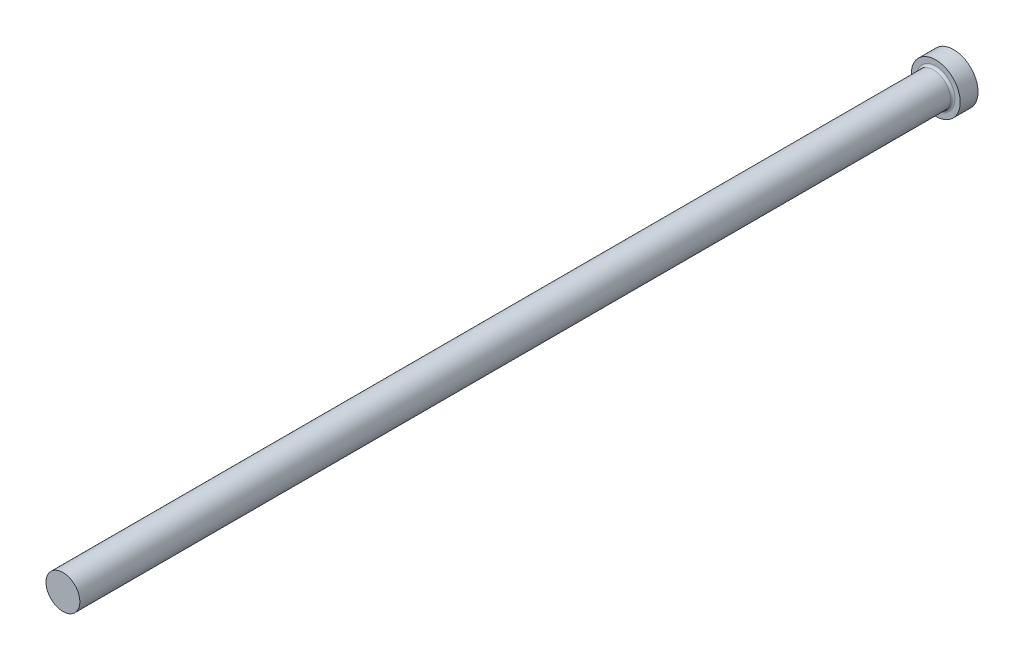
ISO-10303-21;
HEADER;
FILE_DESCRIPTION(('STEP AP214'),'2;1');
FILE_NAME('part.step','',(''),(''),'','','');
FILE_SCHEMA(('AUTOMOTIVE_DESIGN { 1 0 10303 214 1 1 1 1 }'));
ENDSEC;
DATA;
#1=APPLICATION_CONTEXT('core data for automotive mechanical design processes');
#2=APPLICATION_PROTOCOL_DEFINITION('international standard','automotive_design',2000,#1);
#3=PRODUCT_CONTEXT('',#1,'mechanical');
#4=PRODUCT('Part','Part','',(#3));
#5=PRODUCT_RELATED_PRODUCT_CATEGORY('part','',(#4));
#6=PRODUCT_DEFINITION_FORMATION('','',#4);
#7=PRODUCT_DEFINITION_CONTEXT('part definition',#1,'design');
#8=PRODUCT_DEFINITION('design','',#6,#7);
#9=PRODUCT_DEFINITION_SHAPE('','',#8);
#10=(LENGTH_UNIT() NAMED_UNIT(*) SI_UNIT(.MILLI.,.METRE.));
#11=(NAMED_UNIT(*) PLANE_ANGLE_UNIT() SI_UNIT($,.RADIAN.));
#12=(NAMED_UNIT(*) SI_UNIT($,.STERADIAN.) SOLID_ANGLE_UNIT());
#13=UNCERTAINTY_MEASURE_WITH_UNIT(LENGTH_MEASURE(1.E-05),#10,'distance_accuracy_value','');
#14=(GEOMETRIC_REPRESENTATION_CONTEXT(3) GLOBAL_UNCERTAINTY_ASSIGNED_CONTEXT((#13)) GLOBAL_UNIT_ASSIGNED_CONTEXT((#10,
#11,#12)) REPRESENTATION_CONTEXT('',''));
#15=CARTESIAN_POINT('',(0.,0.,0.));
#16=DIRECTION('',(0.,0.,1.));
#17=DIRECTION('',(1.,0.,0.));
#18=AXIS2_PLACEMENT_3D('',#15,#16,#17);
#19=CARTESIAN_POINT('',(5.5,0.,4.));
#20=DIRECTION('',(0.,0.,-1.));
#21=DIRECTION('',(-1.,0.,0.));
#22=AXIS2_PLACEMENT_3D('',#19,#20,#21);
#23=PLANE('',#22);
#24=CARTESIAN_POINT('',(0.,0.,4.));
#25=DIRECTION('',(0.,0.,-1.));
#26=DIRECTION('',(-1.,0.,0.));
#27=AXIS2_PLACEMENT_3D('',#24,#25,#26);
#28=CIRCLE('',#27,4.30000000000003);
#29=CARTESIAN_POINT('',(-4.30000000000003,0.,4.));
#30=VERTEX_POINT('',#29);
#31=EDGE_CURVE('E40',#30,#30,#28,.T.);
#32=ORIENTED_EDGE('',*,*,#31,.T.);
#33=EDGE_LOOP('',(#32));
#34=FACE_BOUND('',#33,.T.);
#35=CARTESIAN_POINT('',(0.,0.,4.));
#36=DIRECTION('',(0.,0.,-1.));
#37=DIRECTION('',(-1.,0.,0.));
#38=AXIS2_PLACEMENT_3D('',#35,#36,#37);
#39=CIRCLE('',#38,5.5);
#40=CARTESIAN_POINT('',(-5.5,0.,4.));
#41=VERTEX_POINT('',#40);
#42=EDGE_CURVE('E44',#41,#41,#39,.T.);
#43=ORIENTED_EDGE('',*,*,#42,.F.);
#44=EDGE_LOOP('',(#43));
#45=FACE_BOUND('',#44,.T.);
#46=ADVANCED_FACE('F33',(#34,#45),#23,.F.);
#47=CARTESIAN_POINT('',(0.,0.,-9.03322817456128));
#48=DIRECTION('',(0.,0.,-1.));
#49=DIRECTION('',(-1.,0.,0.));
#50=AXIS2_PLACEMENT_3D('',#47,#48,#49);
#51=CYLINDRICAL_SURFACE('',#50,5.5);
#52=CARTESIAN_POINT('',(0.,0.,0.));
#53=DIRECTION('',(0.,0.,-1.));
#54=DIRECTION('',(-1.,0.,0.));
#55=AXIS2_PLACEMENT_3D('',#52,#53,#54);
#56=CIRCLE('',#55,5.5);
#57=CARTESIAN_POINT('',(-5.5,0.,0.));
#58=VERTEX_POINT('',#57);
#59=EDGE_CURVE('E48',#58,#58,#56,.T.);
#60=ORIENTED_EDGE('',*,*,#59,.F.);
#61=EDGE_LOOP('',(#60));
#62=FACE_BOUND('',#61,.T.);
#63=ORIENTED_EDGE('',*,*,#42,.T.);
#64=EDGE_LOOP('',(#63));
#65=FACE_BOUND('',#64,.T.);
#66=ADVANCED_FACE('F68',(#62,#65),#51,.T.);
#67=CARTESIAN_POINT('',(0.,0.,0.));
#68=DIRECTION('',(0.,0.,1.));
#69=DIRECTION('',(1.,0.,0.));
#70=AXIS2_PLACEMENT_3D('',#67,#68,#69);
#71=PLANE('',#70);
#72=ORIENTED_EDGE('',*,*,#59,.T.);
#73=EDGE_LOOP('',(#72));
#74=FACE_BOUND('',#73,.T.);
#75=ADVANCED_FACE('F61',(#74),#71,.F.);
#76=CARTESIAN_POINT('',(0.,0.,200.));
#77=DIRECTION('',(0.,0.,-1.));
#78=DIRECTION('',(-1.,0.,0.));
#79=AXIS2_PLACEMENT_3D('',#76,#77,#78);
#80=PLANE('',#79);
#81=CARTESIAN_POINT('',(0.,0.,200.));
#82=DIRECTION('',(0.,0.,-1.));
#83=DIRECTION('',(-1.,0.,0.));
#84=AXIS2_PLACEMENT_3D('',#81,#82,#83);
#85=CIRCLE('',#84,3.80000000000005);
#86=CARTESIAN_POINT('',(-3.80000000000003,0.,200.));
#87=VERTEX_POINT('',#86);
#88=EDGE_CURVE('E53',#87,#87,#85,.T.);
#89=ORIENTED_EDGE('',*,*,#88,.F.);
#90=EDGE_LOOP('',(#89));
#91=FACE_BOUND('',#90,.T.);
#92=ADVANCED_FACE('F59',(#91),#80,.F.);
#93=CARTESIAN_POINT('',(0.,0.,-9.03322817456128));
#94=DIRECTION('',(0.,0.,-1.));
#95=DIRECTION('',(-1.,0.,0.));
#96=AXIS2_PLACEMENT_3D('',#93,#94,#95);
#97=CYLINDRICAL_SURFACE('',#96,3.80000000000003);
#98=CARTESIAN_POINT('',(0.,0.,4.5));
#99=DIRECTION('',(0.,0.,-1.));
#100=DIRECTION('',(-1.,0.,0.));
#101=AXIS2_PLACEMENT_3D('',#98,#99,#100);
#102=CIRCLE('',#101,3.80000000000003);
#103=CARTESIAN_POINT('',(-3.80000000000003,0.,4.5));
#104=VERTEX_POINT('',#103);
#105=EDGE_CURVE('E10',#104,#104,#102,.F.);
#106=ORIENTED_EDGE('',*,*,#105,.T.);
#107=EDGE_LOOP('',(#106));
#108=FACE_BOUND('',#107,.T.);
#109=ORIENTED_EDGE('',*,*,#88,.T.);
#110=EDGE_LOOP('',(#109));
#111=FACE_BOUND('',#110,.T.);
#112=ADVANCED_FACE('F57',(#108,#111),#97,.T.);
#113=CARTESIAN_POINT('',(0.,0.,4.5));
#114=DIRECTION('',(0.,0.,-1.));
#115=DIRECTION('',(-1.,0.,0.));
#116=AXIS2_PLACEMENT_3D('',#113,#114,#115);
#117=TOROIDAL_SURFACE('',#116,4.30000000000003,0.5);
#118=ORIENTED_EDGE('',*,*,#105,.F.);
#119=EDGE_LOOP('',(#118));
#120=FACE_BOUND('',#119,.T.);
#121=ORIENTED_EDGE('',*,*,#31,.F.);
#122=EDGE_LOOP('',(#121));
#123=FACE_BOUND('',#122,.T.);
#124=ADVANCED_FACE('F35',(#120,#123),#117,.F.);
#125=CLOSED_SHELL('',(#46,#66,#75,#92,#112,#124));
#126=MANIFOLD_SOLID_BREP('B2',#125);
#127=ADVANCED_BREP_SHAPE_REPRESENTATION('',(#18,#126),#14);
#128=SHAPE_DEFINITION_REPRESENTATION(#9,#127);
ENDSEC;
END-ISO-10303-21;
